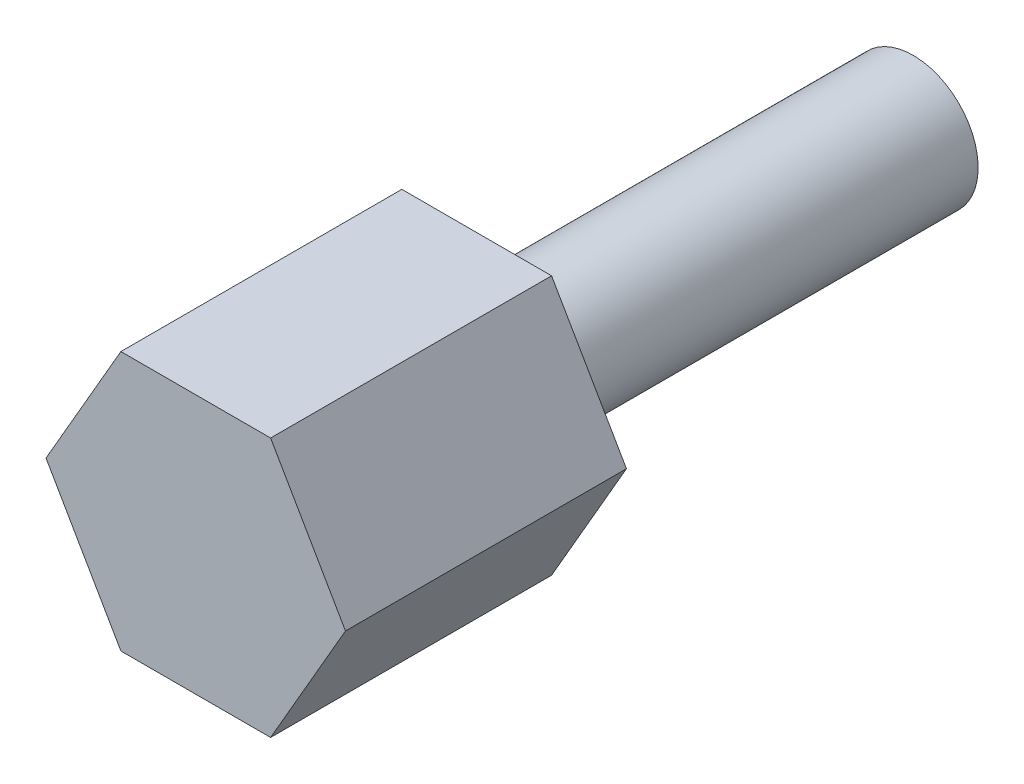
from build123d import *

# Parameters (mm, degrees)
EXTRUDE1_DEPTH = 6.5
SKETCH2_R      = 1.5
EXTRUDE2_DEPTH = 10.1


with BuildPart() as part:
    # Sketch1 → Extrude1 (new body)
    with BuildSketch(Plane.XY):
        Polygon((1.732050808, -3), (3.464101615, 0), (1.732050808, 3), (-1.732050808, 3), (-3.464101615, 0), (-1.732050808, -3), align=None)
    extrude(amount=EXTRUDE1_DEPTH)

    # Sketch2 → Extrude2 (add)
    with BuildSketch(Plane(origin=(0, 0, 0), x_dir=(-1, 0, 0), z_dir=(0, 0, -1))):
        Circle(SKETCH2_R)
    extrude(amount=EXTRUDE2_DEPTH)


solid = part.part
